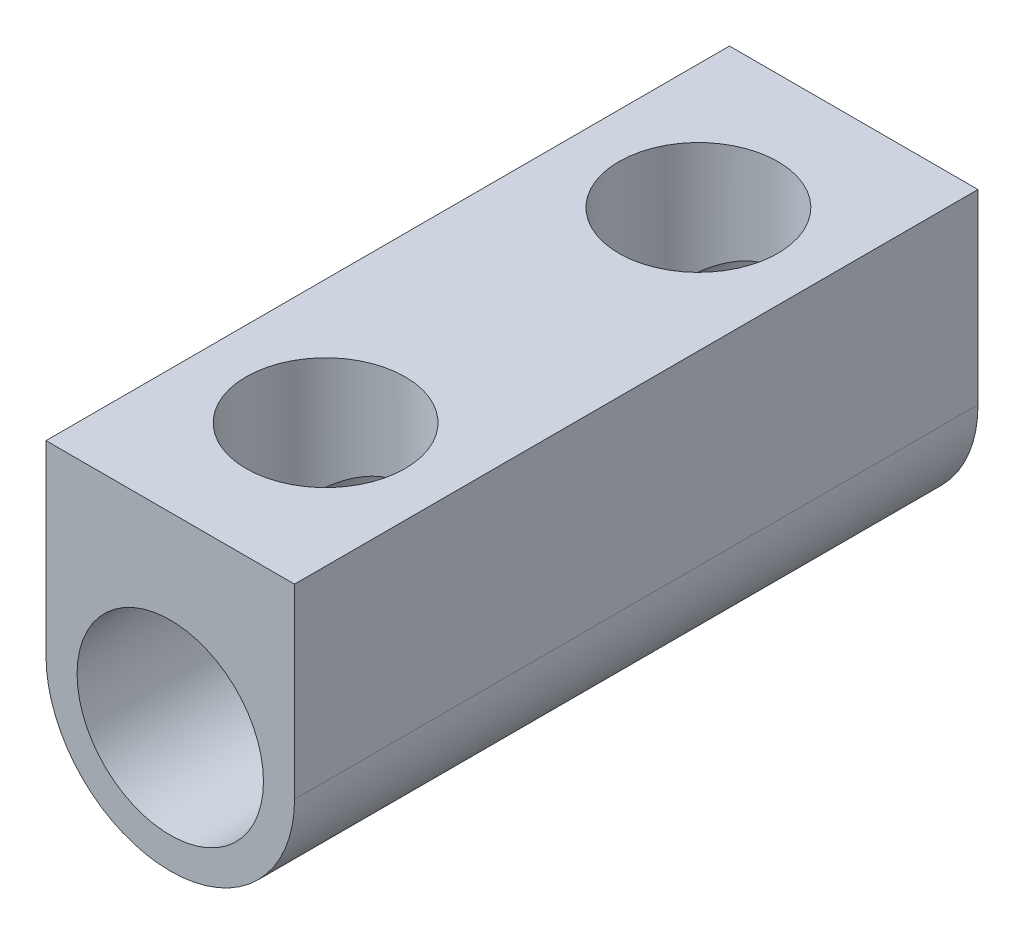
ISO-10303-21;
HEADER;
FILE_DESCRIPTION(('STEP AP214'),'2;1');
FILE_NAME('part.step','',(''),(''),'','','');
FILE_SCHEMA(('AUTOMOTIVE_DESIGN { 1 0 10303 214 1 1 1 1 }'));
ENDSEC;
DATA;
#1=APPLICATION_CONTEXT('core data for automotive mechanical design processes');
#2=APPLICATION_PROTOCOL_DEFINITION('international standard','automotive_design',2000,#1);
#3=PRODUCT_CONTEXT('',#1,'mechanical');
#4=PRODUCT('Part','Part','',(#3));
#5=PRODUCT_RELATED_PRODUCT_CATEGORY('part','',(#4));
#6=PRODUCT_DEFINITION_FORMATION('','',#4);
#7=PRODUCT_DEFINITION_CONTEXT('part definition',#1,'design');
#8=PRODUCT_DEFINITION('design','',#6,#7);
#9=PRODUCT_DEFINITION_SHAPE('','',#8);
#10=(LENGTH_UNIT() NAMED_UNIT(*) SI_UNIT(.MILLI.,.METRE.));
#11=(NAMED_UNIT(*) PLANE_ANGLE_UNIT() SI_UNIT($,.RADIAN.));
#12=(NAMED_UNIT(*) SI_UNIT($,.STERADIAN.) SOLID_ANGLE_UNIT());
#13=UNCERTAINTY_MEASURE_WITH_UNIT(LENGTH_MEASURE(1.E-05),#10,'distance_accuracy_value','');
#14=(GEOMETRIC_REPRESENTATION_CONTEXT(3) GLOBAL_UNCERTAINTY_ASSIGNED_CONTEXT((#13)) GLOBAL_UNIT_ASSIGNED_CONTEXT((#10,
#11,#12)) REPRESENTATION_CONTEXT('',''));
#15=CARTESIAN_POINT('',(0.,0.,0.));
#16=DIRECTION('',(0.,0.,1.));
#17=DIRECTION('',(1.,0.,0.));
#18=AXIS2_PLACEMENT_3D('',#15,#16,#17);
#19=CARTESIAN_POINT('',(-6.65870379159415,2.14285714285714,11.));
#20=DIRECTION('',(0.,0.,1.));
#21=DIRECTION('',(1.,0.,0.));
#22=AXIS2_PLACEMENT_3D('',#19,#20,#21);
#23=PLANE('',#22);
#24=DIRECTION('',(0.,-1.,0.));
#25=VECTOR('',#24,1.);
#26=CARTESIAN_POINT('',(-8.65870379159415,5.14285714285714,11.));
#27=LINE('',#26,#25);
#28=CARTESIAN_POINT('',(-8.65870379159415,5.14285714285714,11.));
#29=VERTEX_POINT('',#28);
#30=CARTESIAN_POINT('',(-8.65870379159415,2.14285714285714,11.));
#31=VERTEX_POINT('',#30);
#32=EDGE_CURVE('E93',#29,#31,#27,.T.);
#33=ORIENTED_EDGE('',*,*,#32,.T.);
#34=CARTESIAN_POINT('',(-6.65870379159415,2.14285714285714,11.));
#35=DIRECTION('',(0.,0.,1.));
#36=DIRECTION('',(1.,0.,0.));
#37=AXIS2_PLACEMENT_3D('',#34,#35,#36);
#38=CIRCLE('',#37,2.);
#39=CARTESIAN_POINT('',(-4.65870379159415,2.14285714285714,11.));
#40=VERTEX_POINT('',#39);
#41=EDGE_CURVE('E88',#31,#40,#38,.T.);
#42=ORIENTED_EDGE('',*,*,#41,.T.);
#43=DIRECTION('',(0.,1.,0.));
#44=VECTOR('',#43,1.);
#45=CARTESIAN_POINT('',(-4.65870379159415,5.14285714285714,11.));
#46=LINE('',#45,#44);
#47=CARTESIAN_POINT('',(-4.65870379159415,5.14285714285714,11.));
#48=VERTEX_POINT('',#47);
#49=EDGE_CURVE('E91',#40,#48,#46,.T.);
#50=ORIENTED_EDGE('',*,*,#49,.T.);
#51=DIRECTION('',(-1.,0.,0.));
#52=VECTOR('',#51,1.);
#53=CARTESIAN_POINT('',(-8.65870379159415,5.14285714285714,11.));
#54=LINE('',#53,#52);
#55=EDGE_CURVE('E58',#48,#29,#54,.T.);
#56=ORIENTED_EDGE('',*,*,#55,.T.);
#57=EDGE_LOOP('',(#33,#42,#50,#56));
#58=FACE_BOUND('',#57,.T.);
#59=CARTESIAN_POINT('',(-6.65870379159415,2.14285714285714,11.));
#60=DIRECTION('',(0.,0.,1.));
#61=DIRECTION('',(1.,0.,0.));
#62=AXIS2_PLACEMENT_3D('',#59,#60,#61);
#63=CIRCLE('',#62,1.5);
#64=CARTESIAN_POINT('',(-5.15870379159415,2.14285714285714,11.));
#65=VERTEX_POINT('',#64);
#66=EDGE_CURVE('E108',#65,#65,#63,.T.);
#67=ORIENTED_EDGE('',*,*,#66,.F.);
#68=EDGE_LOOP('',(#67));
#69=FACE_BOUND('',#68,.T.);
#70=ADVANCED_FACE('F41',(#58,#69),#23,.T.);
#71=CARTESIAN_POINT('',(-6.65870379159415,2.14285714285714,0.));
#72=DIRECTION('',(0.,0.,1.));
#73=DIRECTION('',(1.,0.,0.));
#74=AXIS2_PLACEMENT_3D('',#71,#72,#73);
#75=PLANE('',#74);
#76=DIRECTION('',(0.,-1.,0.));
#77=VECTOR('',#76,1.);
#78=CARTESIAN_POINT('',(-8.65870379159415,5.14285714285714,0.));
#79=LINE('',#78,#77);
#80=CARTESIAN_POINT('',(-8.65870379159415,5.14285714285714,0.));
#81=VERTEX_POINT('',#80);
#82=CARTESIAN_POINT('',(-8.65870379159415,2.14285714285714,0.));
#83=VERTEX_POINT('',#82);
#84=EDGE_CURVE('E105',#81,#83,#79,.T.);
#85=ORIENTED_EDGE('',*,*,#84,.F.);
#86=DIRECTION('',(-1.,0.,0.));
#87=VECTOR('',#86,1.);
#88=CARTESIAN_POINT('',(-8.65870379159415,5.14285714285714,0.));
#89=LINE('',#88,#87);
#90=CARTESIAN_POINT('',(-4.65870379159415,5.14285714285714,0.));
#91=VERTEX_POINT('',#90);
#92=EDGE_CURVE('E81',#91,#81,#89,.T.);
#93=ORIENTED_EDGE('',*,*,#92,.F.);
#94=DIRECTION('',(0.,1.,0.));
#95=VECTOR('',#94,1.);
#96=CARTESIAN_POINT('',(-4.65870379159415,5.14285714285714,0.));
#97=LINE('',#96,#95);
#98=CARTESIAN_POINT('',(-4.65870379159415,2.14285714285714,0.));
#99=VERTEX_POINT('',#98);
#100=EDGE_CURVE('E75',#99,#91,#97,.T.);
#101=ORIENTED_EDGE('',*,*,#100,.F.);
#102=CARTESIAN_POINT('',(-6.65870379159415,2.14285714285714,0.));
#103=DIRECTION('',(0.,0.,1.));
#104=DIRECTION('',(1.,0.,0.));
#105=AXIS2_PLACEMENT_3D('',#102,#103,#104);
#106=CIRCLE('',#105,2.);
#107=EDGE_CURVE('E97',#83,#99,#106,.T.);
#108=ORIENTED_EDGE('',*,*,#107,.F.);
#109=EDGE_LOOP('',(#85,#93,#101,#108));
#110=FACE_BOUND('',#109,.T.);
#111=CARTESIAN_POINT('',(-6.65870379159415,2.14285714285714,0.));
#112=DIRECTION('',(0.,0.,1.));
#113=DIRECTION('',(1.,0.,0.));
#114=AXIS2_PLACEMENT_3D('',#111,#112,#113);
#115=CIRCLE('',#114,1.5);
#116=CARTESIAN_POINT('',(-5.15870379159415,2.14285714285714,0.));
#117=VERTEX_POINT('',#116);
#118=EDGE_CURVE('E120',#117,#117,#115,.T.);
#119=ORIENTED_EDGE('',*,*,#118,.T.);
#120=EDGE_LOOP('',(#119));
#121=FACE_BOUND('',#120,.T.);
#122=ADVANCED_FACE('F116',(#110,#121),#75,.F.);
#123=CARTESIAN_POINT('',(-8.65870379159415,5.14285714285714,11.));
#124=DIRECTION('',(1.,0.,0.));
#125=DIRECTION('',(0.,0.,-1.));
#126=AXIS2_PLACEMENT_3D('',#123,#124,#125);
#127=PLANE('',#126);
#128=ORIENTED_EDGE('',*,*,#84,.T.);
#129=DIRECTION('',(0.,0.,-1.));
#130=VECTOR('',#129,1.);
#131=CARTESIAN_POINT('',(-8.65870379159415,2.14285714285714,11.));
#132=LINE('',#131,#130);
#133=EDGE_CURVE('E11',#31,#83,#132,.T.);
#134=ORIENTED_EDGE('',*,*,#133,.F.);
#135=ORIENTED_EDGE('',*,*,#32,.F.);
#136=DIRECTION('',(0.,0.,-1.));
#137=VECTOR('',#136,1.);
#138=CARTESIAN_POINT('',(-8.65870379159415,5.14285714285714,11.));
#139=LINE('',#138,#137);
#140=EDGE_CURVE('E101',#29,#81,#139,.T.);
#141=ORIENTED_EDGE('',*,*,#140,.T.);
#142=EDGE_LOOP('',(#128,#134,#135,#141));
#143=FACE_BOUND('',#142,.T.);
#144=ADVANCED_FACE('F43',(#143),#127,.F.);
#145=CARTESIAN_POINT('',(-6.65870379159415,2.14285714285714,11.));
#146=DIRECTION('',(0.,0.,-1.));
#147=DIRECTION('',(-1.,0.,0.));
#148=AXIS2_PLACEMENT_3D('',#145,#146,#147);
#149=CYLINDRICAL_SURFACE('',#148,2.);
#150=ORIENTED_EDGE('',*,*,#107,.T.);
#151=DIRECTION('',(0.,0.,-1.));
#152=VECTOR('',#151,1.);
#153=CARTESIAN_POINT('',(-4.65870379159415,2.14285714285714,11.));
#154=LINE('',#153,#152);
#155=EDGE_CURVE('E50',#40,#99,#154,.T.);
#156=ORIENTED_EDGE('',*,*,#155,.F.);
#157=ORIENTED_EDGE('',*,*,#41,.F.);
#158=ORIENTED_EDGE('',*,*,#133,.T.);
#159=EDGE_LOOP('',(#150,#156,#157,#158));
#160=FACE_BOUND('',#159,.T.);
#161=ADVANCED_FACE('F96',(#160),#149,.T.);
#162=CARTESIAN_POINT('',(-4.65870379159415,5.14285714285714,11.));
#163=DIRECTION('',(-1.,0.,0.));
#164=DIRECTION('',(0.,0.,1.));
#165=AXIS2_PLACEMENT_3D('',#162,#163,#164);
#166=PLANE('',#165);
#167=ORIENTED_EDGE('',*,*,#100,.T.);
#168=DIRECTION('',(0.,0.,-1.));
#169=VECTOR('',#168,1.);
#170=CARTESIAN_POINT('',(-4.65870379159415,5.14285714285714,11.));
#171=LINE('',#170,#169);
#172=EDGE_CURVE('E98',#48,#91,#171,.T.);
#173=ORIENTED_EDGE('',*,*,#172,.F.);
#174=ORIENTED_EDGE('',*,*,#49,.F.);
#175=ORIENTED_EDGE('',*,*,#155,.T.);
#176=EDGE_LOOP('',(#167,#173,#174,#175));
#177=FACE_BOUND('',#176,.T.);
#178=ADVANCED_FACE('F99',(#177),#166,.F.);
#179=CARTESIAN_POINT('',(-8.65870379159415,5.14285714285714,11.));
#180=DIRECTION('',(0.,-1.,0.));
#181=DIRECTION('',(1.,0.,0.));
#182=AXIS2_PLACEMENT_3D('',#179,#180,#181);
#183=PLANE('',#182);
#184=CARTESIAN_POINT('',(-6.65870379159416,5.14285714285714,2.5));
#185=DIRECTION('',(0.,1.,0.));
#186=DIRECTION('',(-1.,0.,0.));
#187=AXIS2_PLACEMENT_3D('',#184,#185,#186);
#188=CIRCLE('',#187,1.28);
#189=CARTESIAN_POINT('',(-7.93870379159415,5.14285714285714,2.5));
#190=VERTEX_POINT('',#189);
#191=EDGE_CURVE('E134',#190,#190,#188,.T.);
#192=ORIENTED_EDGE('',*,*,#191,.F.);
#193=EDGE_LOOP('',(#192));
#194=FACE_BOUND('',#193,.T.);
#195=CARTESIAN_POINT('',(-6.65870379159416,5.14285714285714,8.5));
#196=DIRECTION('',(0.,1.,0.));
#197=DIRECTION('',(1.,0.,0.));
#198=AXIS2_PLACEMENT_3D('',#195,#196,#197);
#199=CIRCLE('',#198,1.28);
#200=CARTESIAN_POINT('',(-5.37870379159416,5.14285714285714,8.5));
#201=VERTEX_POINT('',#200);
#202=EDGE_CURVE('E135',#201,#201,#199,.T.);
#203=ORIENTED_EDGE('',*,*,#202,.F.);
#204=EDGE_LOOP('',(#203));
#205=FACE_BOUND('',#204,.T.);
#206=ORIENTED_EDGE('',*,*,#92,.T.);
#207=ORIENTED_EDGE('',*,*,#140,.F.);
#208=ORIENTED_EDGE('',*,*,#55,.F.);
#209=ORIENTED_EDGE('',*,*,#172,.T.);
#210=EDGE_LOOP('',(#206,#207,#208,#209));
#211=FACE_BOUND('',#210,.T.);
#212=ADVANCED_FACE('F113',(#194,#205,#211),#183,.F.);
#213=CARTESIAN_POINT('',(-6.65870379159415,2.14285714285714,11.));
#214=DIRECTION('',(0.,0.,-1.));
#215=DIRECTION('',(-1.,0.,0.));
#216=AXIS2_PLACEMENT_3D('',#213,#214,#215);
#217=CYLINDRICAL_SURFACE('',#216,1.5);
#218=CARTESIAN_POINT('',(-7.93870379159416,2.92490573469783,2.5));
#219=CARTESIAN_POINT('',(-7.93870026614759,2.92491555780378,2.54334503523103));
#220=CARTESIAN_POINT('',(-7.93647307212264,2.92859200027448,2.58675911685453));
#221=CARTESIAN_POINT('',(-7.92781102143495,2.94249921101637,2.67212338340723));
#222=CARTESIAN_POINT('',(-7.92136192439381,2.95275215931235,2.71406810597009));
#223=CARTESIAN_POINT('',(-7.90135338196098,2.98325496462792,2.81255542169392));
#224=CARTESIAN_POINT('',(-7.88595644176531,3.00588551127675,2.86796190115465));
#225=CARTESIAN_POINT('',(-7.84895775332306,3.05624703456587,2.97421496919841));
#226=CARTESIAN_POINT('',(-7.82733417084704,3.08399583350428,3.02504467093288));
#227=CARTESIAN_POINT('',(-7.7660029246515,3.15632954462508,3.14735479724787));
#228=CARTESIAN_POINT('',(-7.72268838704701,3.20230749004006,3.21621189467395));
#229=CARTESIAN_POINT('',(-7.62362556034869,3.29327984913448,3.3449219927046));
#230=CARTESIAN_POINT('',(-7.56788978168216,3.33827520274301,3.40478395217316));
#231=CARTESIAN_POINT('',(-7.45755953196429,3.41378604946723,3.50218532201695));
#232=CARTESIAN_POINT('',(-7.40543473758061,3.44530403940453,3.54173434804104));
#233=CARTESIAN_POINT('',(-7.29374329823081,3.50324904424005,3.61333188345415));
#234=CARTESIAN_POINT('',(-7.23418921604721,3.52968446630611,3.64539279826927));
#235=CARTESIAN_POINT('',(-7.11974450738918,3.57130198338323,3.69541169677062));
#236=CARTESIAN_POINT('',(-7.06593868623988,3.58765261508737,3.71486861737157));
#237=CARTESIAN_POINT('',(-6.9548306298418,3.61444338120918,3.74661107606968));
#238=CARTESIAN_POINT('',(-6.89753047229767,3.62488699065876,3.75890083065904));
#239=CARTESIAN_POINT('',(-6.78067472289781,3.63905245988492,3.77554686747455));
#240=CARTESIAN_POINT('',(-6.72110989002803,3.64274286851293,3.77986602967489));
#241=CARTESIAN_POINT('',(-6.60194905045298,3.64296609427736,3.78012773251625));
#242=CARTESIAN_POINT('',(-6.54235304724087,3.63949959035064,3.77607106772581));
#243=CARTESIAN_POINT('',(-6.42954479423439,3.62625526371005,3.76050970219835));
#244=CARTESIAN_POINT('',(-6.37619009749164,3.6169732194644,3.74958987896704));
#245=CARTESIAN_POINT('',(-6.272382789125,3.59323421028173,3.72149493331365));
#246=CARTESIAN_POINT('',(-6.22193064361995,3.57877641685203,3.70431880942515));
#247=CARTESIAN_POINT('',(-6.12098576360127,3.54425757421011,3.6629547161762));
#248=CARTESIAN_POINT('',(-6.07079559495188,3.52384795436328,3.63832499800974));
#249=CARTESIAN_POINT('',(-5.97530470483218,3.47917709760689,3.58369610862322));
#250=CARTESIAN_POINT('',(-5.93000772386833,3.454912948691,3.5536928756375));
#251=CARTESIAN_POINT('',(-5.82316334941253,3.39083650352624,3.47299973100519));
#252=CARTESIAN_POINT('',(-5.76478954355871,3.34930854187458,3.41945913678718));
#253=CARTESIAN_POINT('',(-5.65945149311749,3.26361875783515,3.30377054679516));
#254=CARTESIAN_POINT('',(-5.6125136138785,3.21945113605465,3.24160317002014));
#255=CARTESIAN_POINT('',(-5.53921740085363,3.1423209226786,3.12358500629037));
#256=CARTESIAN_POINT('',(-5.51060333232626,3.10902528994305,3.06933900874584));
#257=CARTESIAN_POINT('',(-5.46082696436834,3.04655280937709,2.95535149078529));
#258=CARTESIAN_POINT('',(-5.43964210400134,3.01736365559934,2.89562731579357));
#259=CARTESIAN_POINT('',(-5.41240305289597,2.97776855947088,2.79446740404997));
#260=CARTESIAN_POINT('',(-5.4036668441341,2.96446728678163,2.75491453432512));
#261=CARTESIAN_POINT('',(-5.38990035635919,2.94304529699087,2.67383918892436));
#262=CARTESIAN_POINT('',(-5.38486063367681,2.93491138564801,2.63232202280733));
#263=CARTESIAN_POINT('',(-5.37888900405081,2.92523334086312,2.54776445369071));
#264=CARTESIAN_POINT('',(-5.37799801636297,2.92375485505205,2.50471308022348));
#265=CARTESIAN_POINT('',(-5.3805442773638,2.92791231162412,2.41907380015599));
#266=CARTESIAN_POINT('',(-5.3839857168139,2.93355514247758,2.3764863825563));
#267=CARTESIAN_POINT('',(-5.39587411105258,2.95242565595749,2.28510758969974));
#268=CARTESIAN_POINT('',(-5.40515572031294,2.96690229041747,2.23669626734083));
#269=CARTESIAN_POINT('',(-5.42852126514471,3.00139403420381,2.14307603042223));
#270=CARTESIAN_POINT('',(-5.44262214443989,3.02142863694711,2.09787910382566));
#271=CARTESIAN_POINT('',(-5.48570019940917,3.07882958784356,1.98189018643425));
#272=CARTESIAN_POINT('',(-5.51835955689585,3.11892290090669,1.9138367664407));
#273=CARTESIAN_POINT('',(-5.5942119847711,3.20117044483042,1.78527968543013));
#274=CARTESIAN_POINT('',(-5.63742318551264,3.24332812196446,1.72478929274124));
#275=CARTESIAN_POINT('',(-5.73658513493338,3.32782009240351,1.60883420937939));
#276=CARTESIAN_POINT('',(-5.7930293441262,3.3700737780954,1.55372734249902));
#277=CARTESIAN_POINT('',(-5.91741545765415,3.4489527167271,1.4534678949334));
#278=CARTESIAN_POINT('',(-5.98532266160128,3.48559433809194,1.40828619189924));
#279=CARTESIAN_POINT('',(-6.10917414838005,3.5396633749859,1.34254748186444));
#280=CARTESIAN_POINT('',(-6.16230862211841,3.55952681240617,1.31869793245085));
#281=CARTESIAN_POINT('',(-6.27295968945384,3.59356089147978,1.27808956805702));
#282=CARTESIAN_POINT('',(-6.33047304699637,3.60773568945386,1.26132557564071));
#283=CARTESIAN_POINT('',(-6.44892280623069,3.62934158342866,1.2358473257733));
#284=CARTESIAN_POINT('',(-6.50987903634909,3.63672822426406,1.22718612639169));
#285=CARTESIAN_POINT('',(-6.63284590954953,3.64389607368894,1.21878059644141));
#286=CARTESIAN_POINT('',(-6.69485611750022,3.64368034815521,1.21903267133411));
#287=CARTESIAN_POINT('',(-6.81147458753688,3.63608548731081,1.2279407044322));
#288=CARTESIAN_POINT('',(-6.86619952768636,3.62942973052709,1.2357480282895));
#289=CARTESIAN_POINT('',(-6.9732506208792,3.61051399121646,1.25804536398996));
#290=CARTESIAN_POINT('',(-7.02557630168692,3.59825291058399,1.27253668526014));
#291=CARTESIAN_POINT('',(-7.12868706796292,3.5683773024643,1.30810870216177));
#292=CARTESIAN_POINT('',(-7.17933755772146,3.55057665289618,1.32941936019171));
#293=CARTESIAN_POINT('',(-7.27620168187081,3.51086390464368,1.37749181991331));
#294=CARTESIAN_POINT('',(-7.32241402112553,3.4889506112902,1.4042552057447));
#295=CARTESIAN_POINT('',(-7.43118035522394,3.43075928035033,1.47640350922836));
#296=CARTESIAN_POINT('',(-7.49092116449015,3.39263733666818,1.52455798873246));
#297=CARTESIAN_POINT('',(-7.59995134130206,3.31275096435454,1.62925069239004));
#298=CARTESIAN_POINT('',(-7.64919940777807,3.27097302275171,1.68582061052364));
#299=CARTESIAN_POINT('',(-7.73806045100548,3.18631019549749,1.80775509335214));
#300=CARTESIAN_POINT('',(-7.77746142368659,3.14341986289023,1.8732726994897));
#301=CARTESIAN_POINT('',(-7.82792448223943,3.08286870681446,1.97769398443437));
#302=CARTESIAN_POINT('',(-7.84329099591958,3.06333926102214,2.01347340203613));
#303=CARTESIAN_POINT('',(-7.87098107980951,3.02654813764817,2.08728213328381));
#304=CARTESIAN_POINT('',(-7.88330871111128,3.00928344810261,2.12530835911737));
#305=CARTESIAN_POINT('',(-7.90472026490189,2.97820343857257,2.20414699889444));
#306=CARTESIAN_POINT('',(-7.91376957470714,2.96442536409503,2.24498401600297));
#307=CARTESIAN_POINT('',(-7.92789505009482,2.94243861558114,2.32872203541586));
#308=CARTESIAN_POINT('',(-7.93298827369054,2.93420605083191,2.37161332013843));
#309=CARTESIAN_POINT('',(-7.9368165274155,2.92798761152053,2.42908303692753));
#310=CARTESIAN_POINT('',(-7.93752270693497,2.92683623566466,2.44322852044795));
#311=CARTESIAN_POINT('',(-7.93846699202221,2.92529356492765,2.47158018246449));
#312=CARTESIAN_POINT('',(-7.93870494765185,2.92490251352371,2.48578637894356));
#313=CARTESIAN_POINT('',(-7.93870379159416,2.92490573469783,2.5));
#314=B_SPLINE_CURVE_WITH_KNOTS('',3,(#218,#219,#220,#221,#222,#223,#224,#225,#226,#227,#228,
#229,#230,#231,#232,#233,#234,#235,#236,#237,#238,#239,#240,#241,#242,#243,#244,#245,#246,#247,
#248,#249,#250,#251,#252,#253,#254,#255,#256,#257,#258,#259,#260,#261,#262,#263,#264,#265,#266,
#267,#268,#269,#270,#271,#272,#273,#274,#275,#276,#277,#278,#279,#280,#281,#282,#283,#284,#285,
#286,#287,#288,#289,#290,#291,#292,#293,#294,#295,#296,#297,#298,#299,#300,#301,#302,#303,#304,
#305,#306,#307,#308,#309,#310,#311,#312,#313),.UNSPECIFIED.,.T.,.F.,(4,2,2,2,2,2,2,2,2,2,2,2,2,
2,2,2,2,2,2,2,2,2,2,2,2,2,2,2,2,2,2,2,2,2,2,2,2,2,2,2,2,2,2,2,2,2,2,4),(0.,0.129970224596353,
0.260381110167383,0.444720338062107,0.629714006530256,0.908664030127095,1.18733436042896,
1.40442193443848,1.62114727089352,1.798930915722,1.97660986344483,2.15511421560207,
2.33360163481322,2.49862594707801,2.6636766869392,2.84157566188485,3.01960968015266,
3.28650449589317,3.55400893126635,3.76284666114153,3.97104458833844,4.09855333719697,
4.22573518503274,4.35416881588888,4.48272677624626,4.63598394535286,4.78978557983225,
5.04484077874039,5.30033734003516,5.56755400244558,5.83397580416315,6.01787378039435,
6.20163714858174,6.38659556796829,6.57147939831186,6.73774964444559,6.90405247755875,
7.07668971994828,7.24937718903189,7.50501535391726,7.7616418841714,8.02339216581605,
8.15391940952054,8.28427126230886,8.41596181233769,8.54708133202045,8.58968727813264,
8.6323068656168),.UNSPECIFIED.);
#315=CARTESIAN_POINT('',(-7.93870379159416,2.92490573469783,2.5));
#316=VERTEX_POINT('',#315);
#317=EDGE_CURVE('E123',#316,#316,#314,.T.);
#318=ORIENTED_EDGE('',*,*,#317,.T.);
#319=EDGE_LOOP('',(#318));
#320=FACE_BOUND('',#319,.T.);
#321=CARTESIAN_POINT('',(-7.93870379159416,2.92490573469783,8.5));
#322=CARTESIAN_POINT('',(-7.93870026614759,2.92491555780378,8.54334503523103));
#323=CARTESIAN_POINT('',(-7.93647307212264,2.92859200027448,8.58675911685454));
#324=CARTESIAN_POINT('',(-7.92781102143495,2.94249921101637,8.67212338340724));
#325=CARTESIAN_POINT('',(-7.92136192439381,2.95275215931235,8.71406810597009));
#326=CARTESIAN_POINT('',(-7.90135338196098,2.98325496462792,8.81255542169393));
#327=CARTESIAN_POINT('',(-7.88595644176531,3.00588551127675,8.86796190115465));
#328=CARTESIAN_POINT('',(-7.84895775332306,3.05624703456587,8.97421496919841));
#329=CARTESIAN_POINT('',(-7.82733417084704,3.08399583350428,9.02504467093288));
#330=CARTESIAN_POINT('',(-7.7660029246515,3.15632954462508,9.14735479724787));
#331=CARTESIAN_POINT('',(-7.72268838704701,3.20230749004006,9.21621189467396));
#332=CARTESIAN_POINT('',(-7.62362556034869,3.29327984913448,9.3449219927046));
#333=CARTESIAN_POINT('',(-7.56788978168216,3.33827520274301,9.40478395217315));
#334=CARTESIAN_POINT('',(-7.45755953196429,3.41378604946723,9.50218532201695));
#335=CARTESIAN_POINT('',(-7.40543473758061,3.44530403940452,9.54173434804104));
#336=CARTESIAN_POINT('',(-7.29374329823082,3.50324904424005,9.61333188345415));
#337=CARTESIAN_POINT('',(-7.23418921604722,3.52968446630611,9.64539279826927));
#338=CARTESIAN_POINT('',(-7.11974450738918,3.57130198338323,9.69541169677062));
#339=CARTESIAN_POINT('',(-7.06593868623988,3.58765261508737,9.71486861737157));
#340=CARTESIAN_POINT('',(-6.9548306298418,3.61444338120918,9.74661107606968));
#341=CARTESIAN_POINT('',(-6.89753047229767,3.62488699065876,9.75890083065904));
#342=CARTESIAN_POINT('',(-6.78067472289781,3.63905245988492,9.77554686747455));
#343=CARTESIAN_POINT('',(-6.72110989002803,3.64274286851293,9.77986602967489));
#344=CARTESIAN_POINT('',(-6.60194905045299,3.64296609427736,9.78012773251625));
#345=CARTESIAN_POINT('',(-6.54235304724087,3.63949959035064,9.77607106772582));
#346=CARTESIAN_POINT('',(-6.42954479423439,3.62625526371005,9.76050970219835));
#347=CARTESIAN_POINT('',(-6.37619009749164,3.6169732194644,9.74958987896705));
#348=CARTESIAN_POINT('',(-6.272382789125,3.59323421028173,9.72149493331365));
#349=CARTESIAN_POINT('',(-6.22193064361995,3.57877641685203,9.70431880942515));
#350=CARTESIAN_POINT('',(-6.12098576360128,3.54425757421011,9.6629547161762));
#351=CARTESIAN_POINT('',(-6.07079559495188,3.52384795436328,9.63832499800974));
#352=CARTESIAN_POINT('',(-5.97530470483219,3.47917709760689,9.58369610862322));
#353=CARTESIAN_POINT('',(-5.93000772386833,3.454912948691,9.5536928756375));
#354=CARTESIAN_POINT('',(-5.82316334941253,3.39083650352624,9.47299973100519));
#355=CARTESIAN_POINT('',(-5.76478954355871,3.34930854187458,9.41945913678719));
#356=CARTESIAN_POINT('',(-5.65945149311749,3.26361875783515,9.30377054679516));
#357=CARTESIAN_POINT('',(-5.6125136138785,3.21945113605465,9.24160317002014));
#358=CARTESIAN_POINT('',(-5.53921740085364,3.1423209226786,9.12358500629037));
#359=CARTESIAN_POINT('',(-5.51060333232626,3.10902528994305,9.06933900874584));
#360=CARTESIAN_POINT('',(-5.46082696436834,3.04655280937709,8.95535149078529));
#361=CARTESIAN_POINT('',(-5.43964210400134,3.01736365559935,8.89562731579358));
#362=CARTESIAN_POINT('',(-5.41240305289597,2.97776855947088,8.79446740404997));
#363=CARTESIAN_POINT('',(-5.4036668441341,2.96446728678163,8.75491453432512));
#364=CARTESIAN_POINT('',(-5.38990035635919,2.94304529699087,8.67383918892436));
#365=CARTESIAN_POINT('',(-5.38486063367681,2.93491138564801,8.63232202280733));
#366=CARTESIAN_POINT('',(-5.37888900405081,2.92523334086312,8.54776445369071));
#367=CARTESIAN_POINT('',(-5.37799801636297,2.92375485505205,8.50471308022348));
#368=CARTESIAN_POINT('',(-5.3805442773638,2.92791231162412,8.41907380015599));
#369=CARTESIAN_POINT('',(-5.3839857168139,2.93355514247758,8.3764863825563));
#370=CARTESIAN_POINT('',(-5.39587411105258,2.95242565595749,8.28510758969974));
#371=CARTESIAN_POINT('',(-5.40515572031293,2.96690229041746,8.23669626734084));
#372=CARTESIAN_POINT('',(-5.42852126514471,3.00139403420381,8.14307603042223));
#373=CARTESIAN_POINT('',(-5.44262214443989,3.0214286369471,8.09787910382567));
#374=CARTESIAN_POINT('',(-5.48570019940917,3.07882958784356,7.98189018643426));
#375=CARTESIAN_POINT('',(-5.51835955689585,3.11892290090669,7.9138367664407));
#376=CARTESIAN_POINT('',(-5.5942119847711,3.20117044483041,7.78527968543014));
#377=CARTESIAN_POINT('',(-5.63742318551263,3.24332812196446,7.72478929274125));
#378=CARTESIAN_POINT('',(-5.73658513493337,3.3278200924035,7.6088342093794));
#379=CARTESIAN_POINT('',(-5.79302934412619,3.37007377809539,7.55372734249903));
#380=CARTESIAN_POINT('',(-5.91741545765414,3.44895271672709,7.45346789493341));
#381=CARTESIAN_POINT('',(-5.98532266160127,3.48559433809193,7.40828619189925));
#382=CARTESIAN_POINT('',(-6.10917414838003,3.53966337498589,7.34254748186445));
#383=CARTESIAN_POINT('',(-6.1623086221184,3.55952681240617,7.31869793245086));
#384=CARTESIAN_POINT('',(-6.27295968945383,3.59356089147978,7.27808956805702));
#385=CARTESIAN_POINT('',(-6.33047304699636,3.60773568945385,7.26132557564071));
#386=CARTESIAN_POINT('',(-6.44892280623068,3.62934158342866,7.2358473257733));
#387=CARTESIAN_POINT('',(-6.50987903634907,3.63672822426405,7.22718612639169));
#388=CARTESIAN_POINT('',(-6.63284590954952,3.64389607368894,7.21878059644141));
#389=CARTESIAN_POINT('',(-6.69485611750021,3.64368034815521,7.21903267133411));
#390=CARTESIAN_POINT('',(-6.81147458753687,3.63608548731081,7.2279407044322));
#391=CARTESIAN_POINT('',(-6.86619952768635,3.62942973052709,7.2357480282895));
#392=CARTESIAN_POINT('',(-6.97325062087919,3.61051399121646,7.25804536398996));
#393=CARTESIAN_POINT('',(-7.02557630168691,3.59825291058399,7.27253668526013));
#394=CARTESIAN_POINT('',(-7.12868706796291,3.5683773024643,7.30810870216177));
#395=CARTESIAN_POINT('',(-7.17933755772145,3.55057665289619,7.32941936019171));
#396=CARTESIAN_POINT('',(-7.2762016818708,3.51086390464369,7.3774918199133));
#397=CARTESIAN_POINT('',(-7.32241402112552,3.4889506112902,7.4042552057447));
#398=CARTESIAN_POINT('',(-7.43118035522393,3.43075928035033,7.47640350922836));
#399=CARTESIAN_POINT('',(-7.49092116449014,3.39263733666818,7.52455798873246));
#400=CARTESIAN_POINT('',(-7.59995134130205,3.31275096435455,7.62925069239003));
#401=CARTESIAN_POINT('',(-7.64919940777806,3.27097302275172,7.68582061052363));
#402=CARTESIAN_POINT('',(-7.73806045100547,3.1863101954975,7.80775509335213));
#403=CARTESIAN_POINT('',(-7.77746142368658,3.14341986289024,7.87327269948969));
#404=CARTESIAN_POINT('',(-7.82792448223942,3.08286870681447,7.97769398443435));
#405=CARTESIAN_POINT('',(-7.84329099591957,3.06333926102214,8.01347340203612));
#406=CARTESIAN_POINT('',(-7.8709810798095,3.02654813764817,8.08728213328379));
#407=CARTESIAN_POINT('',(-7.88330871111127,3.00928344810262,8.12530835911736));
#408=CARTESIAN_POINT('',(-7.90472026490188,2.97820343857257,8.20414699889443));
#409=CARTESIAN_POINT('',(-7.91376957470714,2.96442536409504,8.24498401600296));
#410=CARTESIAN_POINT('',(-7.92789505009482,2.94243861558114,8.32872203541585));
#411=CARTESIAN_POINT('',(-7.93298827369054,2.93420605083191,8.37161332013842));
#412=CARTESIAN_POINT('',(-7.9368165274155,2.92798761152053,8.42908303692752));
#413=CARTESIAN_POINT('',(-7.93752270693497,2.92683623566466,8.44322852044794));
#414=CARTESIAN_POINT('',(-7.93846699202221,2.92529356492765,8.47158018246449));
#415=CARTESIAN_POINT('',(-7.93870494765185,2.92490251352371,8.48578637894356));
#416=CARTESIAN_POINT('',(-7.93870379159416,2.92490573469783,8.5));
#417=B_SPLINE_CURVE_WITH_KNOTS('',3,(#321,#322,#323,#324,#325,#326,#327,#328,#329,#330,#331,
#332,#333,#334,#335,#336,#337,#338,#339,#340,#341,#342,#343,#344,#345,#346,#347,#348,#349,#350,
#351,#352,#353,#354,#355,#356,#357,#358,#359,#360,#361,#362,#363,#364,#365,#366,#367,#368,#369,
#370,#371,#372,#373,#374,#375,#376,#377,#378,#379,#380,#381,#382,#383,#384,#385,#386,#387,#388,
#389,#390,#391,#392,#393,#394,#395,#396,#397,#398,#399,#400,#401,#402,#403,#404,#405,#406,#407,
#408,#409,#410,#411,#412,#413,#414,#415,#416),.UNSPECIFIED.,.T.,.F.,(4,2,2,2,2,2,2,2,2,2,2,2,2,
2,2,2,2,2,2,2,2,2,2,2,2,2,2,2,2,2,2,2,2,2,2,2,2,2,2,2,2,2,2,2,2,2,2,4),(0.,0.129970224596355,
0.260381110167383,0.444720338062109,0.629714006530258,0.908664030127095,1.18733436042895,
1.40442193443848,1.62114727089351,1.798930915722,1.97660986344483,2.15511421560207,
2.33360163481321,2.49862594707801,2.6636766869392,2.84157566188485,3.01960968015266,
3.28650449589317,3.55400893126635,3.76284666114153,3.97104458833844,4.09855333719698,
4.22573518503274,4.35416881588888,4.48272677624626,4.63598394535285,4.78978557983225,
5.04484077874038,5.30033734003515,5.56755400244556,5.83397580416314,6.01787378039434,
6.20163714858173,6.38659556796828,6.57147939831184,6.73774964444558,6.90405247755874,
7.07668971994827,7.24937718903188,7.50501535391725,7.76164188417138,8.02339216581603,
8.15391940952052,8.28427126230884,8.41596181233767,8.54708133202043,8.58968727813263,
8.6323068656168),.UNSPECIFIED.);
#418=CARTESIAN_POINT('',(-7.93870379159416,2.92490573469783,8.5));
#419=VERTEX_POINT('',#418);
#420=EDGE_CURVE('E126',#419,#419,#417,.T.);
#421=ORIENTED_EDGE('',*,*,#420,.T.);
#422=EDGE_LOOP('',(#421));
#423=FACE_BOUND('',#422,.T.);
#424=ORIENTED_EDGE('',*,*,#66,.T.);
#425=EDGE_LOOP('',(#424));
#426=FACE_BOUND('',#425,.T.);
#427=ORIENTED_EDGE('',*,*,#118,.F.);
#428=EDGE_LOOP('',(#427));
#429=FACE_BOUND('',#428,.T.);
#430=ADVANCED_FACE('F159',(#320,#423,#426,#429),#217,.F.);
#431=CARTESIAN_POINT('',(-6.65870379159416,0.141857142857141,8.5));
#432=DIRECTION('',(0.,1.,0.));
#433=DIRECTION('',(-1.,0.,0.));
#434=AXIS2_PLACEMENT_3D('',#431,#432,#433);
#435=CYLINDRICAL_SURFACE('',#434,1.28);
#436=ORIENTED_EDGE('',*,*,#202,.T.);
#437=EDGE_LOOP('',(#436));
#438=FACE_BOUND('',#437,.T.);
#439=ORIENTED_EDGE('',*,*,#420,.F.);
#440=EDGE_LOOP('',(#439));
#441=FACE_BOUND('',#440,.T.);
#442=ADVANCED_FACE('F137',(#438,#441),#435,.F.);
#443=CARTESIAN_POINT('',(-6.65870379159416,0.141857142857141,2.5));
#444=DIRECTION('',(0.,1.,0.));
#445=DIRECTION('',(-1.,0.,0.));
#446=AXIS2_PLACEMENT_3D('',#443,#444,#445);
#447=CYLINDRICAL_SURFACE('',#446,1.28);
#448=ORIENTED_EDGE('',*,*,#191,.T.);
#449=EDGE_LOOP('',(#448));
#450=FACE_BOUND('',#449,.T.);
#451=ORIENTED_EDGE('',*,*,#317,.F.);
#452=EDGE_LOOP('',(#451));
#453=FACE_BOUND('',#452,.T.);
#454=ADVANCED_FACE('F142',(#450,#453),#447,.F.);
#455=CLOSED_SHELL('',(#70,#122,#144,#161,#178,#212,#430,#442,#454));
#456=MANIFOLD_SOLID_BREP('B2',#455);
#457=ADVANCED_BREP_SHAPE_REPRESENTATION('',(#18,#456),#14);
#458=SHAPE_DEFINITION_REPRESENTATION(#9,#457);
ENDSEC;
END-ISO-10303-21;
